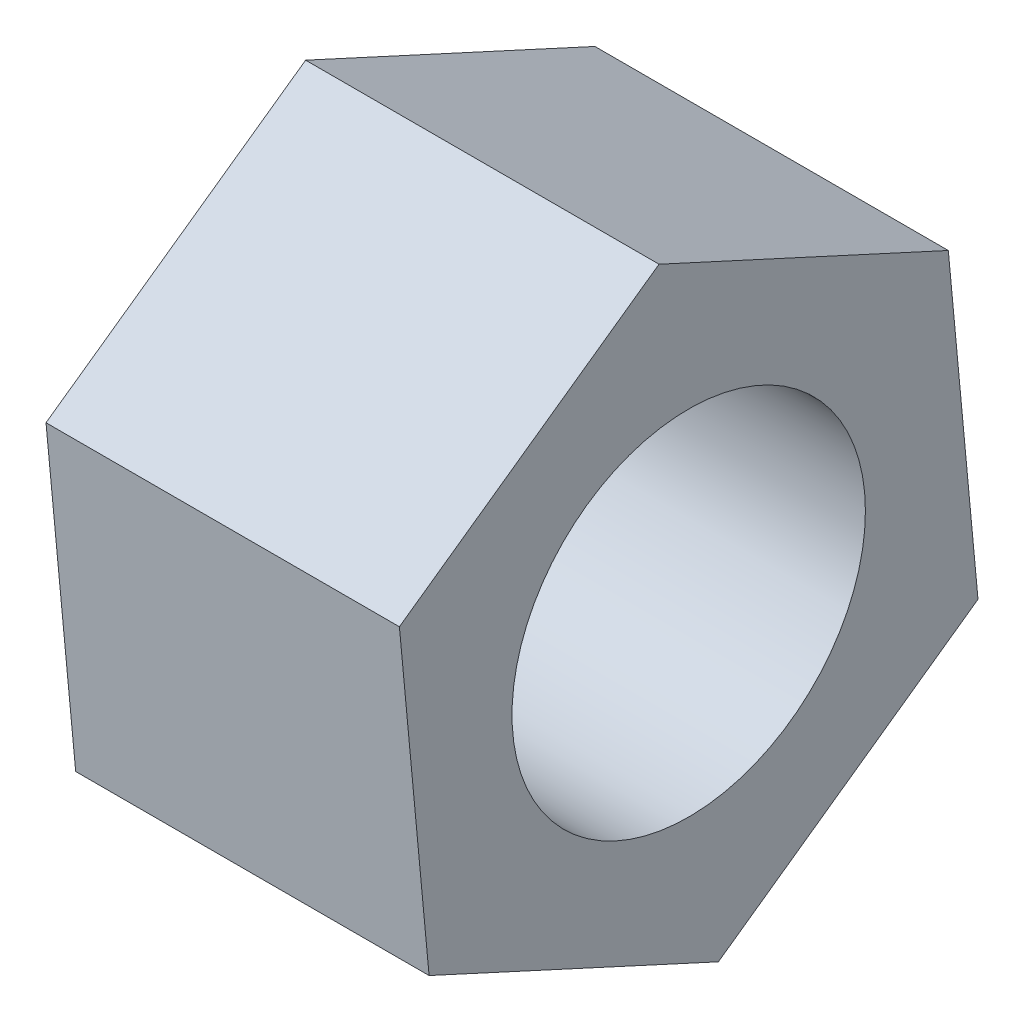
from build123d import *

# Parameters (mm, degrees)
SKETCH1_R           = 0.5
BOSS_EXTRUDE1_DEPTH = 1


with BuildPart() as part:
    # Sketch1 → Boss-Extrude1 (new body)
    with BuildSketch(Plane(origin=(0, 0, 0), x_dir=(0, 0, -1), z_dir=(1, 0, 0))):
        Polygon((-30.540294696, 17.157549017), (-29.805684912, 17.678652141), (-29.889668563, 18.575394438), (-30.708261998, 18.95103361), (-31.442871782, 18.429930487), (-31.358888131, 17.53318819), align=None)
        with Locations((-30.624278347, 18.054291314)):
            Circle(SKETCH1_R, mode=Mode.SUBTRACT)
    extrude(amount=BOSS_EXTRUDE1_DEPTH)


solid = part.part
